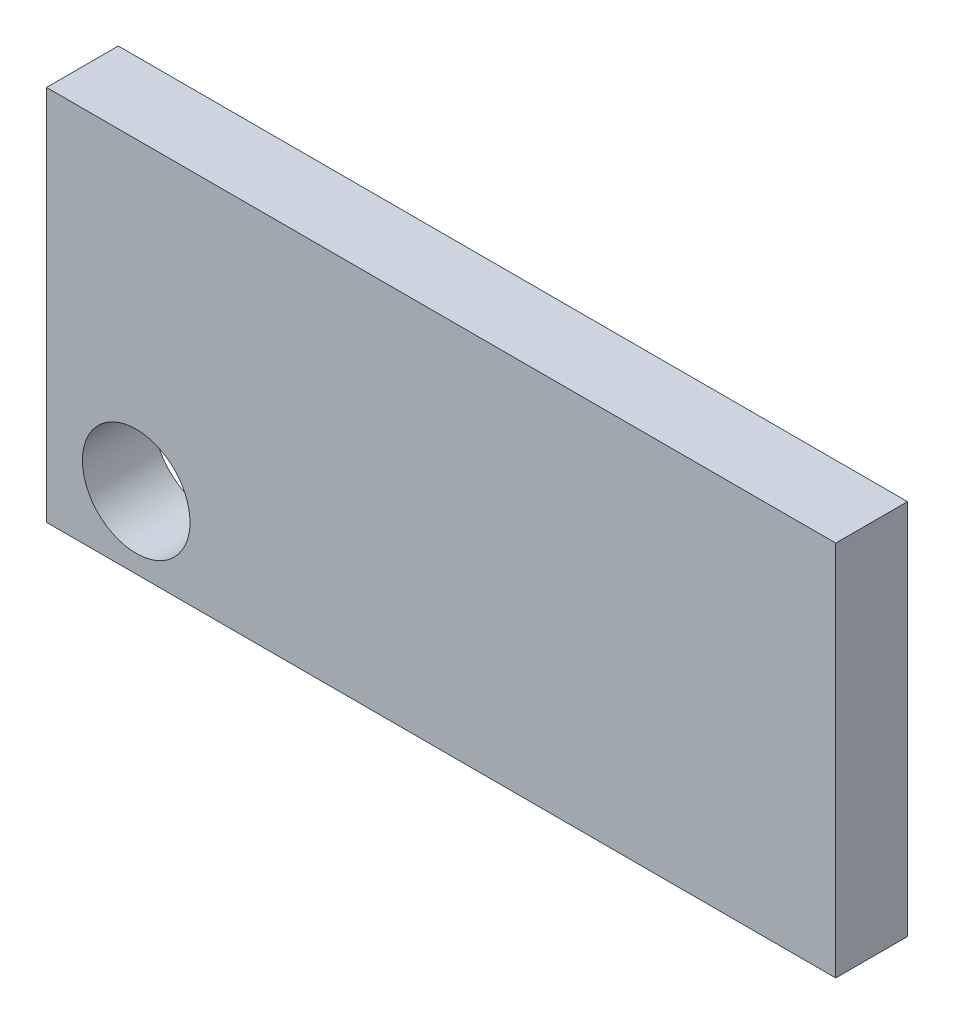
from build123d import *

# Parameters (mm, degrees)
SKETCH2_W           = 1117.6
SKETCH2_H           = 533.4
BOSS_EXTRUDE1_DEPTH = 101.6
SKETCH7_R           = 76.2
CUT_EXTRUDE1_DEPTH  = 1243.524800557
SKETCH8_R           = 4.8895
CUT_EXTRUDE2_DEPTH  = 50.8
LPATTERN1_COUNT     = 10
LPATTERN1_PITCH     = 101.6


with BuildPart() as part:
    # Sketch2 → Boss-Extrude1 (new body)
    with BuildSketch(Plane.XY):
        with Locations((558.8, 266.7)):
            Rectangle(SKETCH2_W, SKETCH2_H)
    extrude(amount=BOSS_EXTRUDE1_DEPTH)

    # Sketch7 → Cut-Extrude1 (cut, through all)
    with BuildSketch(Plane(origin=(0, 0, 0), x_dir=(-1, 0, 0), z_dir=(0, 0, -1))):
        with Locations((-127, 101.6)):
            Circle(SKETCH7_R)
    extrude(amount=-CUT_EXTRUDE1_DEPTH, mode=Mode.SUBTRACT)

    # Sketch8 → Cut-Extrude2 (cut)
    with BuildSketch(Plane(origin=(0, 0, 0), x_dir=(-1, 0, 0), z_dir=(0, 0, -1))):
        with Locations((-1041.4, 457.2)):
            Circle(SKETCH8_R)
    cut_extrude2 = extrude(amount=-CUT_EXTRUDE2_DEPTH, mode=Mode.SUBTRACT)

    # LPattern1: Cut-Extrude2 ×10
    with Locations(*[(-i * LPATTERN1_PITCH, 0, 0) for i in range(1, LPATTERN1_COUNT)]):
        add(cut_extrude2, mode=Mode.SUBTRACT)


solid = part.part
